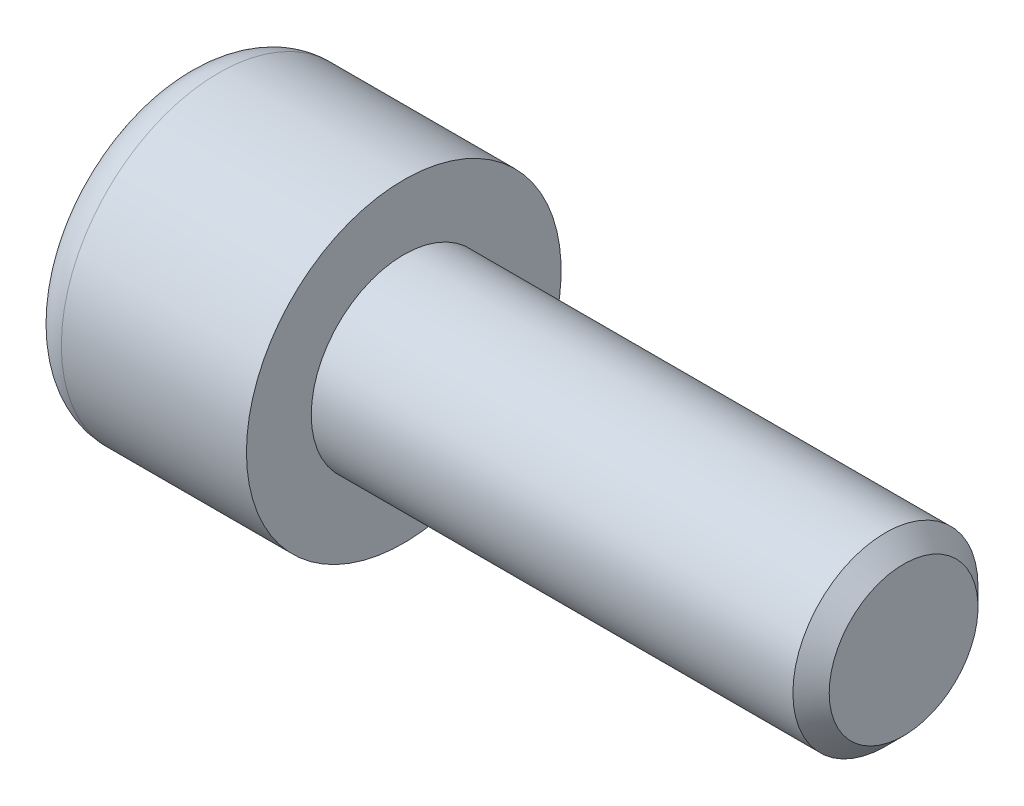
ISO-10303-21;
HEADER;
FILE_DESCRIPTION(('STEP AP214'),'2;1');
FILE_NAME('part.step','',(''),(''),'','','');
FILE_SCHEMA(('AUTOMOTIVE_DESIGN { 1 0 10303 214 1 1 1 1 }'));
ENDSEC;
DATA;
#1=APPLICATION_CONTEXT('core data for automotive mechanical design processes');
#2=APPLICATION_PROTOCOL_DEFINITION('international standard','automotive_design',2000,#1);
#3=PRODUCT_CONTEXT('',#1,'mechanical');
#4=PRODUCT('Part','Part','',(#3));
#5=PRODUCT_RELATED_PRODUCT_CATEGORY('part','',(#4));
#6=PRODUCT_DEFINITION_FORMATION('','',#4);
#7=PRODUCT_DEFINITION_CONTEXT('part definition',#1,'design');
#8=PRODUCT_DEFINITION('design','',#6,#7);
#9=PRODUCT_DEFINITION_SHAPE('','',#8);
#10=(LENGTH_UNIT() NAMED_UNIT(*) SI_UNIT(.MILLI.,.METRE.));
#11=(NAMED_UNIT(*) PLANE_ANGLE_UNIT() SI_UNIT($,.RADIAN.));
#12=(NAMED_UNIT(*) SI_UNIT($,.STERADIAN.) SOLID_ANGLE_UNIT());
#13=UNCERTAINTY_MEASURE_WITH_UNIT(LENGTH_MEASURE(1.E-05),#10,'distance_accuracy_value','');
#14=(GEOMETRIC_REPRESENTATION_CONTEXT(3) GLOBAL_UNCERTAINTY_ASSIGNED_CONTEXT((#13)) GLOBAL_UNIT_ASSIGNED_CONTEXT((#10,
#11,#12)) REPRESENTATION_CONTEXT('',''));
#15=CARTESIAN_POINT('',(0.,0.,0.));
#16=DIRECTION('',(0.,0.,1.));
#17=DIRECTION('',(1.,0.,0.));
#18=AXIS2_PLACEMENT_3D('',#15,#16,#17);
#19=CARTESIAN_POINT('',(2.275,0.,0.));
#20=DIRECTION('',(1.,0.,0.));
#21=DIRECTION('',(0.,0.,-1.));
#22=AXIS2_PLACEMENT_3D('',#19,#20,#21);
#23=PLANE('',#22);
#24=DIRECTION('',(0.,0.5,0.866025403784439));
#25=VECTOR('',#24,1.);
#26=CARTESIAN_POINT('',(2.275,1.15470053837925,-2.));
#27=LINE('',#26,#25);
#28=CARTESIAN_POINT('',(2.275,1.15470053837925,-2.));
#29=VERTEX_POINT('',#28);
#30=CARTESIAN_POINT('',(2.275,1.73205080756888,-1.));
#31=VERTEX_POINT('',#30);
#32=EDGE_CURVE('E111',#29,#31,#27,.T.);
#33=ORIENTED_EDGE('',*,*,#32,.F.);
#34=DIRECTION('',(0.,1.,0.));
#35=VECTOR('',#34,1.);
#36=CARTESIAN_POINT('',(2.275,0.,-2.));
#37=LINE('',#36,#35);
#38=CARTESIAN_POINT('',(2.275,0.,-2.));
#39=VERTEX_POINT('',#38);
#40=EDGE_CURVE('E107',#39,#29,#37,.T.);
#41=ORIENTED_EDGE('',*,*,#40,.F.);
#42=CARTESIAN_POINT('',(2.275,0.,0.));
#43=DIRECTION('',(-1.,0.,0.));
#44=DIRECTION('',(0.,0.,1.));
#45=AXIS2_PLACEMENT_3D('',#42,#43,#44);
#46=CIRCLE('',#45,2.);
#47=EDGE_CURVE('E118',#39,#31,#46,.F.);
#48=ORIENTED_EDGE('',*,*,#47,.T.);
#49=EDGE_LOOP('',(#33,#41,#48));
#50=FACE_BOUND('',#49,.T.);
#51=ADVANCED_FACE('F36',(#50),#23,.F.);
#52=CARTESIAN_POINT('',(2.275,0.,0.));
#53=DIRECTION('',(1.,0.,0.));
#54=DIRECTION('',(0.,0.,-1.));
#55=AXIS2_PLACEMENT_3D('',#52,#53,#54);
#56=PLANE('',#55);
#57=DIRECTION('',(0.,-0.5,0.866025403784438));
#58=VECTOR('',#57,1.);
#59=CARTESIAN_POINT('',(2.275,2.3094010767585,0.));
#60=LINE('',#59,#58);
#61=CARTESIAN_POINT('',(2.275,2.3094010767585,0.));
#62=VERTEX_POINT('',#61);
#63=CARTESIAN_POINT('',(2.275,1.73205080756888,1.));
#64=VERTEX_POINT('',#63);
#65=EDGE_CURVE('E129',#62,#64,#60,.T.);
#66=ORIENTED_EDGE('',*,*,#65,.F.);
#67=DIRECTION('',(0.,0.5,0.866025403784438));
#68=VECTOR('',#67,1.);
#69=CARTESIAN_POINT('',(2.275,1.73205080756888,-1.));
#70=LINE('',#69,#68);
#71=EDGE_CURVE('E114',#31,#62,#70,.T.);
#72=ORIENTED_EDGE('',*,*,#71,.F.);
#73=CARTESIAN_POINT('',(2.275,0.,0.));
#74=DIRECTION('',(-1.,0.,0.));
#75=DIRECTION('',(0.,0.,1.));
#76=AXIS2_PLACEMENT_3D('',#73,#74,#75);
#77=CIRCLE('',#76,2.);
#78=EDGE_CURVE('E122',#31,#64,#77,.F.);
#79=ORIENTED_EDGE('',*,*,#78,.T.);
#80=EDGE_LOOP('',(#66,#72,#79));
#81=FACE_BOUND('',#80,.T.);
#82=ADVANCED_FACE('F127',(#81),#56,.F.);
#83=CARTESIAN_POINT('',(2.275,0.,0.));
#84=DIRECTION('',(1.,0.,0.));
#85=DIRECTION('',(0.,0.,-1.));
#86=AXIS2_PLACEMENT_3D('',#83,#84,#85);
#87=PLANE('',#86);
#88=DIRECTION('',(0.,1.,0.));
#89=VECTOR('',#88,1.);
#90=CARTESIAN_POINT('',(2.275,0.,2.));
#91=LINE('',#90,#89);
#92=CARTESIAN_POINT('',(2.275,1.15470053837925,2.));
#93=VERTEX_POINT('',#92);
#94=CARTESIAN_POINT('',(2.275,0.,2.));
#95=VERTEX_POINT('',#94);
#96=EDGE_CURVE('E123',#93,#95,#91,.F.);
#97=ORIENTED_EDGE('',*,*,#96,.F.);
#98=DIRECTION('',(0.,-0.5,0.866025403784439));
#99=VECTOR('',#98,1.);
#100=CARTESIAN_POINT('',(2.275,1.73205080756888,1.));
#101=LINE('',#100,#99);
#102=EDGE_CURVE('E175',#64,#93,#101,.T.);
#103=ORIENTED_EDGE('',*,*,#102,.F.);
#104=CARTESIAN_POINT('',(2.275,0.,0.));
#105=DIRECTION('',(-1.,0.,0.));
#106=DIRECTION('',(0.,0.,1.));
#107=AXIS2_PLACEMENT_3D('',#104,#105,#106);
#108=CIRCLE('',#107,2.);
#109=EDGE_CURVE('E135',#64,#95,#108,.F.);
#110=ORIENTED_EDGE('',*,*,#109,.T.);
#111=EDGE_LOOP('',(#97,#103,#110));
#112=FACE_BOUND('',#111,.T.);
#113=ADVANCED_FACE('F284',(#112),#87,.F.);
#114=CARTESIAN_POINT('',(2.34529946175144,0.,0.));
#115=DIRECTION('',(-1.,0.,0.));
#116=DIRECTION('',(0.,0.,1.));
#117=AXIS2_PLACEMENT_3D('',#114,#115,#116);
#118=CONICAL_SURFACE('',#117,1.99999999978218,1.04719755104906);
#119=CARTESIAN_POINT('',(3.5000000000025,0.,-3.41060513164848E-10));
#120=VERTEX_POINT('',#119);
#121=VERTEX_LOOP('',#120);
#122=FACE_BOUND('',#121,.T.);
#123=CARTESIAN_POINT('',(2.34529946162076,0.,0.));
#124=DIRECTION('',(-1.,0.,0.));
#125=DIRECTION('',(0.,0.,1.));
#126=AXIS2_PLACEMENT_3D('',#123,#124,#125);
#127=CIRCLE('',#126,2.);
#128=CARTESIAN_POINT('',(2.34529946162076,0.,2.));
#129=VERTEX_POINT('',#128);
#130=EDGE_CURVE('E144',#129,#129,#127,.T.);
#131=ORIENTED_EDGE('',*,*,#130,.T.);
#132=EDGE_LOOP('',(#131));
#133=FACE_BOUND('',#132,.T.);
#134=ADVANCED_FACE('F389',(#122,#133),#118,.F.);
#135=CARTESIAN_POINT('',(2.275,0.,0.));
#136=DIRECTION('',(1.,0.,0.));
#137=DIRECTION('',(0.,0.,-1.));
#138=AXIS2_PLACEMENT_3D('',#135,#136,#137);
#139=PLANE('',#138);
#140=DIRECTION('',(0.,0.5,-0.866025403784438));
#141=VECTOR('',#140,1.);
#142=CARTESIAN_POINT('',(2.275,-2.3094010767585,0.));
#143=LINE('',#142,#141);
#144=CARTESIAN_POINT('',(2.275,-2.3094010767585,0.));
#145=VERTEX_POINT('',#144);
#146=CARTESIAN_POINT('',(2.275,-1.73205080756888,-1.));
#147=VERTEX_POINT('',#146);
#148=EDGE_CURVE('E196',#145,#147,#143,.T.);
#149=ORIENTED_EDGE('',*,*,#148,.F.);
#150=DIRECTION('',(0.,-0.5,-0.866025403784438));
#151=VECTOR('',#150,1.);
#152=CARTESIAN_POINT('',(2.275,-1.73205080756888,1.));
#153=LINE('',#152,#151);
#154=CARTESIAN_POINT('',(2.275,-1.73205080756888,1.));
#155=VERTEX_POINT('',#154);
#156=EDGE_CURVE('E137',#155,#145,#153,.T.);
#157=ORIENTED_EDGE('',*,*,#156,.F.);
#158=CARTESIAN_POINT('',(2.275,0.,0.));
#159=DIRECTION('',(-1.,0.,0.));
#160=DIRECTION('',(0.,0.,1.));
#161=AXIS2_PLACEMENT_3D('',#158,#159,#160);
#162=CIRCLE('',#161,2.);
#163=EDGE_CURVE('E140',#155,#147,#162,.F.);
#164=ORIENTED_EDGE('',*,*,#163,.T.);
#165=EDGE_LOOP('',(#149,#157,#164));
#166=FACE_BOUND('',#165,.T.);
#167=ADVANCED_FACE('F397',(#166),#139,.F.);
#168=CARTESIAN_POINT('',(2.275,0.,0.));
#169=DIRECTION('',(1.,0.,0.));
#170=DIRECTION('',(0.,0.,-1.));
#171=AXIS2_PLACEMENT_3D('',#168,#169,#170);
#172=PLANE('',#171);
#173=DIRECTION('',(0.,1.,0.));
#174=VECTOR('',#173,1.);
#175=CARTESIAN_POINT('',(2.275,0.,-2.));
#176=LINE('',#175,#174);
#177=CARTESIAN_POINT('',(2.275,-1.15470053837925,-2.));
#178=VERTEX_POINT('',#177);
#179=EDGE_CURVE('E184',#178,#39,#176,.T.);
#180=ORIENTED_EDGE('',*,*,#179,.F.);
#181=DIRECTION('',(0.,0.5,-0.866025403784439));
#182=VECTOR('',#181,1.);
#183=CARTESIAN_POINT('',(2.275,-1.73205080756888,-1.));
#184=LINE('',#183,#182);
#185=EDGE_CURVE('E200',#147,#178,#184,.T.);
#186=ORIENTED_EDGE('',*,*,#185,.F.);
#187=CARTESIAN_POINT('',(2.275,0.,0.));
#188=DIRECTION('',(-1.,0.,0.));
#189=DIRECTION('',(0.,0.,1.));
#190=AXIS2_PLACEMENT_3D('',#187,#188,#189);
#191=CIRCLE('',#190,2.);
#192=EDGE_CURVE('E143',#147,#39,#191,.F.);
#193=ORIENTED_EDGE('',*,*,#192,.T.);
#194=EDGE_LOOP('',(#180,#186,#193));
#195=FACE_BOUND('',#194,.T.);
#196=ADVANCED_FACE('F302',(#195),#172,.F.);
#197=CARTESIAN_POINT('',(1.17264973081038,0.,0.));
#198=DIRECTION('',(-1.,0.,0.));
#199=DIRECTION('',(0.,0.,1.));
#200=AXIS2_PLACEMENT_3D('',#197,#198,#199);
#201=CYLINDRICAL_SURFACE('',#200,2.);
#202=ORIENTED_EDGE('',*,*,#130,.F.);
#203=EDGE_LOOP('',(#202));
#204=FACE_BOUND('',#203,.T.);
#205=ORIENTED_EDGE('',*,*,#192,.F.);
#206=ORIENTED_EDGE('',*,*,#163,.F.);
#207=CARTESIAN_POINT('',(2.275,0.,0.));
#208=DIRECTION('',(-1.,0.,0.));
#209=DIRECTION('',(0.,0.,1.));
#210=AXIS2_PLACEMENT_3D('',#207,#208,#209);
#211=CIRCLE('',#210,2.);
#212=EDGE_CURVE('E146',#155,#95,#211,.T.);
#213=ORIENTED_EDGE('',*,*,#212,.T.);
#214=ORIENTED_EDGE('',*,*,#109,.F.);
#215=ORIENTED_EDGE('',*,*,#78,.F.);
#216=ORIENTED_EDGE('',*,*,#47,.F.);
#217=EDGE_LOOP('',(#205,#206,#213,#214,#215,#216));
#218=FACE_BOUND('',#217,.T.);
#219=ADVANCED_FACE('F132',(#204,#218),#201,.F.);
#220=CARTESIAN_POINT('',(2.275,0.,0.));
#221=DIRECTION('',(1.,0.,0.));
#222=DIRECTION('',(0.,0.,-1.));
#223=AXIS2_PLACEMENT_3D('',#220,#221,#222);
#224=PLANE('',#223);
#225=DIRECTION('',(0.,-0.5,-0.866025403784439));
#226=VECTOR('',#225,1.);
#227=CARTESIAN_POINT('',(2.275,-2.3094010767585,0.));
#228=LINE('',#227,#226);
#229=CARTESIAN_POINT('',(2.275,-1.15470053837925,2.));
#230=VERTEX_POINT('',#229);
#231=EDGE_CURVE('E211',#155,#230,#228,.F.);
#232=ORIENTED_EDGE('',*,*,#231,.T.);
#233=DIRECTION('',(0.,1.,0.));
#234=VECTOR('',#233,1.);
#235=CARTESIAN_POINT('',(2.275,-1.15470053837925,2.));
#236=LINE('',#235,#234);
#237=EDGE_CURVE('E148',#230,#95,#236,.T.);
#238=ORIENTED_EDGE('',*,*,#237,.T.);
#239=ORIENTED_EDGE('',*,*,#212,.F.);
#240=EDGE_LOOP('',(#232,#238,#239));
#241=FACE_BOUND('',#240,.T.);
#242=ADVANCED_FACE('F305',(#241),#224,.F.);
#243=CARTESIAN_POINT('',(0.,-1.15470053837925,2.));
#244=DIRECTION('',(0.,0.,1.));
#245=DIRECTION('',(1.,0.,0.));
#246=AXIS2_PLACEMENT_3D('',#243,#244,#245);
#247=PLANE('',#246);
#248=DIRECTION('',(1.,0.,0.));
#249=VECTOR('',#248,1.);
#250=CARTESIAN_POINT('',(0.,1.15470053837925,2.));
#251=LINE('',#250,#249);
#252=CARTESIAN_POINT('',(0.,1.15470053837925,2.));
#253=VERTEX_POINT('',#252);
#254=EDGE_CURVE('E155',#253,#93,#251,.T.);
#255=ORIENTED_EDGE('',*,*,#254,.T.);
#256=ORIENTED_EDGE('',*,*,#96,.T.);
#257=ORIENTED_EDGE('',*,*,#237,.F.);
#258=DIRECTION('',(1.,0.,0.));
#259=VECTOR('',#258,1.);
#260=CARTESIAN_POINT('',(0.,-1.15470053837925,2.));
#261=LINE('',#260,#259);
#262=CARTESIAN_POINT('',(0.,-1.15470053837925,2.));
#263=VERTEX_POINT('',#262);
#264=EDGE_CURVE('E189',#230,#263,#261,.F.);
#265=ORIENTED_EDGE('',*,*,#264,.T.);
#266=DIRECTION('',(0.,1.,0.));
#267=VECTOR('',#266,1.);
#268=CARTESIAN_POINT('',(0.,0.,2.));
#269=LINE('',#268,#267);
#270=EDGE_CURVE('E160',#253,#263,#269,.F.);
#271=ORIENTED_EDGE('',*,*,#270,.F.);
#272=EDGE_LOOP('',(#255,#256,#257,#265,#271));
#273=FACE_BOUND('',#272,.T.);
#274=ADVANCED_FACE('F277',(#273),#247,.F.);
#275=CARTESIAN_POINT('',(0.,-2.3094010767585,0.));
#276=DIRECTION('',(0.,-0.866025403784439,0.5));
#277=DIRECTION('',(0.,-0.5,-0.866025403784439));
#278=AXIS2_PLACEMENT_3D('',#275,#276,#277);
#279=PLANE('',#278);
#280=ORIENTED_EDGE('',*,*,#264,.F.);
#281=ORIENTED_EDGE('',*,*,#231,.F.);
#282=ORIENTED_EDGE('',*,*,#156,.T.);
#283=DIRECTION('',(1.,0.,0.));
#284=VECTOR('',#283,1.);
#285=CARTESIAN_POINT('',(0.,-2.3094010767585,0.));
#286=LINE('',#285,#284);
#287=CARTESIAN_POINT('',(0.,-2.3094010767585,0.));
#288=VERTEX_POINT('',#287);
#289=EDGE_CURVE('E187',#145,#288,#286,.F.);
#290=ORIENTED_EDGE('',*,*,#289,.T.);
#291=DIRECTION('',(0.,-0.5,-0.866025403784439));
#292=VECTOR('',#291,1.);
#293=CARTESIAN_POINT('',(0.,-1.15470053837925,2.));
#294=LINE('',#293,#292);
#295=EDGE_CURVE('E270',#263,#288,#294,.T.);
#296=ORIENTED_EDGE('',*,*,#295,.F.);
#297=EDGE_LOOP('',(#280,#281,#282,#290,#296));
#298=FACE_BOUND('',#297,.T.);
#299=ADVANCED_FACE('F289',(#298),#279,.F.);
#300=CARTESIAN_POINT('',(0.,-1.15470053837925,-2.));
#301=DIRECTION('',(0.,-0.866025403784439,-0.5));
#302=DIRECTION('',(0.,0.5,-0.866025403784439));
#303=AXIS2_PLACEMENT_3D('',#300,#301,#302);
#304=PLANE('',#303);
#305=ORIENTED_EDGE('',*,*,#289,.F.);
#306=ORIENTED_EDGE('',*,*,#148,.T.);
#307=ORIENTED_EDGE('',*,*,#185,.T.);
#308=DIRECTION('',(-1.,0.,0.));
#309=VECTOR('',#308,1.);
#310=CARTESIAN_POINT('',(0.,-1.15470053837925,-2.));
#311=LINE('',#310,#309);
#312=CARTESIAN_POINT('',(0.,-1.15470053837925,-2.));
#313=VERTEX_POINT('',#312);
#314=EDGE_CURVE('E156',#178,#313,#311,.T.);
#315=ORIENTED_EDGE('',*,*,#314,.T.);
#316=DIRECTION('',(0.,0.5,-0.866025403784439));
#317=VECTOR('',#316,1.);
#318=CARTESIAN_POINT('',(0.,-2.3094010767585,0.));
#319=LINE('',#318,#317);
#320=EDGE_CURVE('E267',#288,#313,#319,.T.);
#321=ORIENTED_EDGE('',*,*,#320,.F.);
#322=EDGE_LOOP('',(#305,#306,#307,#315,#321));
#323=FACE_BOUND('',#322,.T.);
#324=ADVANCED_FACE('F294',(#323),#304,.F.);
#325=CARTESIAN_POINT('',(0.,1.15470053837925,-2.));
#326=DIRECTION('',(0.,0.,-1.));
#327=DIRECTION('',(-1.,0.,0.));
#328=AXIS2_PLACEMENT_3D('',#325,#326,#327);
#329=PLANE('',#328);
#330=ORIENTED_EDGE('',*,*,#314,.F.);
#331=ORIENTED_EDGE('',*,*,#179,.T.);
#332=ORIENTED_EDGE('',*,*,#40,.T.);
#333=DIRECTION('',(1.,0.,0.));
#334=VECTOR('',#333,1.);
#335=CARTESIAN_POINT('',(0.,1.15470053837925,-2.));
#336=LINE('',#335,#334);
#337=CARTESIAN_POINT('',(0.,1.15470053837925,-2.));
#338=VERTEX_POINT('',#337);
#339=EDGE_CURVE('E115',#29,#338,#336,.F.);
#340=ORIENTED_EDGE('',*,*,#339,.T.);
#341=DIRECTION('',(0.,1.,0.));
#342=VECTOR('',#341,1.);
#343=CARTESIAN_POINT('',(0.,0.,-2.));
#344=LINE('',#343,#342);
#345=EDGE_CURVE('E264',#313,#338,#344,.T.);
#346=ORIENTED_EDGE('',*,*,#345,.F.);
#347=EDGE_LOOP('',(#330,#331,#332,#340,#346));
#348=FACE_BOUND('',#347,.T.);
#349=ADVANCED_FACE('F298',(#348),#329,.F.);
#350=CARTESIAN_POINT('',(0.,2.3094010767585,0.));
#351=DIRECTION('',(0.,0.866025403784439,-0.5));
#352=DIRECTION('',(0.,0.5,0.866025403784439));
#353=AXIS2_PLACEMENT_3D('',#350,#351,#352);
#354=PLANE('',#353);
#355=ORIENTED_EDGE('',*,*,#339,.F.);
#356=ORIENTED_EDGE('',*,*,#32,.T.);
#357=ORIENTED_EDGE('',*,*,#71,.T.);
#358=DIRECTION('',(1.,0.,0.));
#359=VECTOR('',#358,1.);
#360=CARTESIAN_POINT('',(0.,2.3094010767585,0.));
#361=LINE('',#360,#359);
#362=CARTESIAN_POINT('',(0.,2.3094010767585,0.));
#363=VERTEX_POINT('',#362);
#364=EDGE_CURVE('E54',#62,#363,#361,.F.);
#365=ORIENTED_EDGE('',*,*,#364,.T.);
#366=DIRECTION('',(0.,0.5,0.866025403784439));
#367=VECTOR('',#366,1.);
#368=CARTESIAN_POINT('',(0.,1.15470053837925,-2.));
#369=LINE('',#368,#367);
#370=EDGE_CURVE('E261',#338,#363,#369,.T.);
#371=ORIENTED_EDGE('',*,*,#370,.F.);
#372=EDGE_LOOP('',(#355,#356,#357,#365,#371));
#373=FACE_BOUND('',#372,.T.);
#374=ADVANCED_FACE('F112',(#373),#354,.F.);
#375=CARTESIAN_POINT('',(0.,1.15470053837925,2.));
#376=DIRECTION('',(0.,0.866025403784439,0.5));
#377=DIRECTION('',(0.,-0.5,0.866025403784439));
#378=AXIS2_PLACEMENT_3D('',#375,#376,#377);
#379=PLANE('',#378);
#380=ORIENTED_EDGE('',*,*,#364,.F.);
#381=ORIENTED_EDGE('',*,*,#65,.T.);
#382=ORIENTED_EDGE('',*,*,#102,.T.);
#383=ORIENTED_EDGE('',*,*,#254,.F.);
#384=DIRECTION('',(0.,-0.5,0.866025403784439));
#385=VECTOR('',#384,1.);
#386=CARTESIAN_POINT('',(0.,2.3094010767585,0.));
#387=LINE('',#386,#385);
#388=EDGE_CURVE('E253',#363,#253,#387,.T.);
#389=ORIENTED_EDGE('',*,*,#388,.F.);
#390=EDGE_LOOP('',(#380,#381,#382,#383,#389));
#391=FACE_BOUND('',#390,.T.);
#392=ADVANCED_FACE('F282',(#391),#379,.F.);
#393=CARTESIAN_POINT('',(0.,0.,-1.625));
#394=DIRECTION('',(-1.,0.,0.));
#395=DIRECTION('',(0.,0.,1.));
#396=AXIS2_PLACEMENT_3D('',#393,#394,#395);
#397=PLANE('',#396);
#398=CARTESIAN_POINT('',(0.,0.,0.));
#399=DIRECTION('',(1.,0.,0.));
#400=DIRECTION('',(0.,0.,-1.));
#401=AXIS2_PLACEMENT_3D('',#398,#399,#400);
#402=CIRCLE('',#401,3.25);
#403=CARTESIAN_POINT('',(0.,0.,-3.25));
#404=VERTEX_POINT('',#403);
#405=EDGE_CURVE('E249',#404,#404,#402,.T.);
#406=ORIENTED_EDGE('',*,*,#405,.F.);
#407=EDGE_LOOP('',(#406));
#408=FACE_BOUND('',#407,.T.);
#409=ORIENTED_EDGE('',*,*,#370,.T.);
#410=ORIENTED_EDGE('',*,*,#388,.T.);
#411=ORIENTED_EDGE('',*,*,#270,.T.);
#412=ORIENTED_EDGE('',*,*,#295,.T.);
#413=ORIENTED_EDGE('',*,*,#320,.T.);
#414=ORIENTED_EDGE('',*,*,#345,.T.);
#415=EDGE_LOOP('',(#409,#410,#411,#412,#413,#414));
#416=FACE_BOUND('',#415,.T.);
#417=ADVANCED_FACE('F237',(#408,#416),#397,.T.);
#418=CARTESIAN_POINT('',(1.,0.,0.));
#419=DIRECTION('',(-1.,0.,0.));
#420=DIRECTION('',(0.,0.,1.));
#421=AXIS2_PLACEMENT_3D('',#418,#419,#420);
#422=TOROIDAL_SURFACE('',#421,3.25,1.);
#423=CARTESIAN_POINT('',(1.,0.,0.));
#424=DIRECTION('',(-1.,0.,0.));
#425=DIRECTION('',(0.,0.,1.));
#426=AXIS2_PLACEMENT_3D('',#423,#424,#425);
#427=CIRCLE('',#426,4.25);
#428=CARTESIAN_POINT('',(1.,0.,4.25));
#429=VERTEX_POINT('',#428);
#430=EDGE_CURVE('E151',#429,#429,#427,.F.);
#431=ORIENTED_EDGE('',*,*,#430,.F.);
#432=EDGE_LOOP('',(#431));
#433=FACE_BOUND('',#432,.T.);
#434=ORIENTED_EDGE('',*,*,#405,.T.);
#435=EDGE_LOOP('',(#434));
#436=FACE_BOUND('',#435,.T.);
#437=ADVANCED_FACE('F225',(#433,#436),#422,.T.);
#438=CARTESIAN_POINT('',(2.25,0.,0.));
#439=DIRECTION('',(-1.,0.,0.));
#440=DIRECTION('',(0.,0.,1.));
#441=AXIS2_PLACEMENT_3D('',#438,#439,#440);
#442=CYLINDRICAL_SURFACE('',#441,4.25);
#443=ORIENTED_EDGE('',*,*,#430,.T.);
#444=EDGE_LOOP('',(#443));
#445=FACE_BOUND('',#444,.T.);
#446=CARTESIAN_POINT('',(6.,0.,0.));
#447=DIRECTION('',(-1.,0.,0.));
#448=DIRECTION('',(0.,0.,1.));
#449=AXIS2_PLACEMENT_3D('',#446,#447,#448);
#450=CIRCLE('',#449,4.25);
#451=CARTESIAN_POINT('',(6.,0.,4.25));
#452=VERTEX_POINT('',#451);
#453=EDGE_CURVE('E339',#452,#452,#450,.T.);
#454=ORIENTED_EDGE('',*,*,#453,.T.);
#455=EDGE_LOOP('',(#454));
#456=FACE_BOUND('',#455,.T.);
#457=ADVANCED_FACE('F236',(#445,#456),#442,.T.);
#458=CARTESIAN_POINT('',(6.,0.,-4.25));
#459=DIRECTION('',(-1.,0.,0.));
#460=DIRECTION('',(0.,0.,1.));
#461=AXIS2_PLACEMENT_3D('',#458,#459,#460);
#462=PLANE('',#461);
#463=CARTESIAN_POINT('',(6.,0.,0.));
#464=DIRECTION('',(-1.,0.,0.));
#465=DIRECTION('',(0.,0.,1.));
#466=AXIS2_PLACEMENT_3D('',#463,#464,#465);
#467=CIRCLE('',#466,2.5);
#468=CARTESIAN_POINT('',(6.,0.,2.5));
#469=VERTEX_POINT('',#468);
#470=EDGE_CURVE('E39',#469,#469,#467,.F.);
#471=ORIENTED_EDGE('',*,*,#470,.F.);
#472=EDGE_LOOP('',(#471));
#473=FACE_BOUND('',#472,.T.);
#474=ORIENTED_EDGE('',*,*,#453,.F.);
#475=EDGE_LOOP('',(#474));
#476=FACE_BOUND('',#475,.T.);
#477=ADVANCED_FACE('F316',(#473,#476),#462,.F.);
#478=CARTESIAN_POINT('',(19.5,0.,-1.00475));
#479=DIRECTION('',(1.,0.,0.));
#480=DIRECTION('',(0.,0.,-1.));
#481=AXIS2_PLACEMENT_3D('',#478,#479,#480);
#482=PLANE('',#481);
#483=CARTESIAN_POINT('',(19.4999999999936,0.,0.));
#484=DIRECTION('',(-1.,0.,0.));
#485=DIRECTION('',(0.,0.,1.));
#486=AXIS2_PLACEMENT_3D('',#483,#484,#485);
#487=CIRCLE('',#486,2.00949999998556);
#488=CARTESIAN_POINT('',(19.4999999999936,0.,2.00949999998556));
#489=VERTEX_POINT('',#488);
#490=EDGE_CURVE('E45',#489,#489,#487,.T.);
#491=ORIENTED_EDGE('',*,*,#490,.F.);
#492=EDGE_LOOP('',(#491));
#493=FACE_BOUND('',#492,.T.);
#494=ADVANCED_FACE('F239',(#493),#482,.T.);
#495=CARTESIAN_POINT('',(19.0094999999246,0.,0.));
#496=DIRECTION('',(-1.,0.,0.));
#497=DIRECTION('',(0.,0.,1.));
#498=AXIS2_PLACEMENT_3D('',#495,#496,#497);
#499=CONICAL_SURFACE('',#498,2.49999999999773,0.785398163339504);
#500=ORIENTED_EDGE('',*,*,#490,.T.);
#501=EDGE_LOOP('',(#500));
#502=FACE_BOUND('',#501,.T.);
#503=CARTESIAN_POINT('',(19.0095,0.,0.));
#504=DIRECTION('',(-1.,0.,0.));
#505=DIRECTION('',(0.,0.,1.));
#506=AXIS2_PLACEMENT_3D('',#503,#504,#505);
#507=CIRCLE('',#506,2.5);
#508=CARTESIAN_POINT('',(19.0095,0.,2.5));
#509=VERTEX_POINT('',#508);
#510=EDGE_CURVE('E11',#509,#509,#507,.T.);
#511=ORIENTED_EDGE('',*,*,#510,.F.);
#512=EDGE_LOOP('',(#511));
#513=FACE_BOUND('',#512,.T.);
#514=ADVANCED_FACE('F326',(#502,#513),#499,.T.);
#515=CARTESIAN_POINT('',(11.25475,0.,0.));
#516=DIRECTION('',(-1.,0.,0.));
#517=DIRECTION('',(0.,0.,1.));
#518=AXIS2_PLACEMENT_3D('',#515,#516,#517);
#519=CYLINDRICAL_SURFACE('',#518,2.5);
#520=ORIENTED_EDGE('',*,*,#510,.T.);
#521=EDGE_LOOP('',(#520));
#522=FACE_BOUND('',#521,.T.);
#523=ORIENTED_EDGE('',*,*,#470,.T.);
#524=EDGE_LOOP('',(#523));
#525=FACE_BOUND('',#524,.T.);
#526=ADVANCED_FACE('F329',(#522,#525),#519,.T.);
#527=CLOSED_SHELL('',(#51,#82,#113,#134,#167,#196,#219,#242,#274,#299,#324,#349,#374,#392,#417,
#437,#457,#477,#494,#514,#526));
#528=MANIFOLD_SOLID_BREP('B2',#527);
#529=ADVANCED_BREP_SHAPE_REPRESENTATION('',(#18,#528),#14);
#530=SHAPE_DEFINITION_REPRESENTATION(#9,#529);
ENDSEC;
END-ISO-10303-21;
